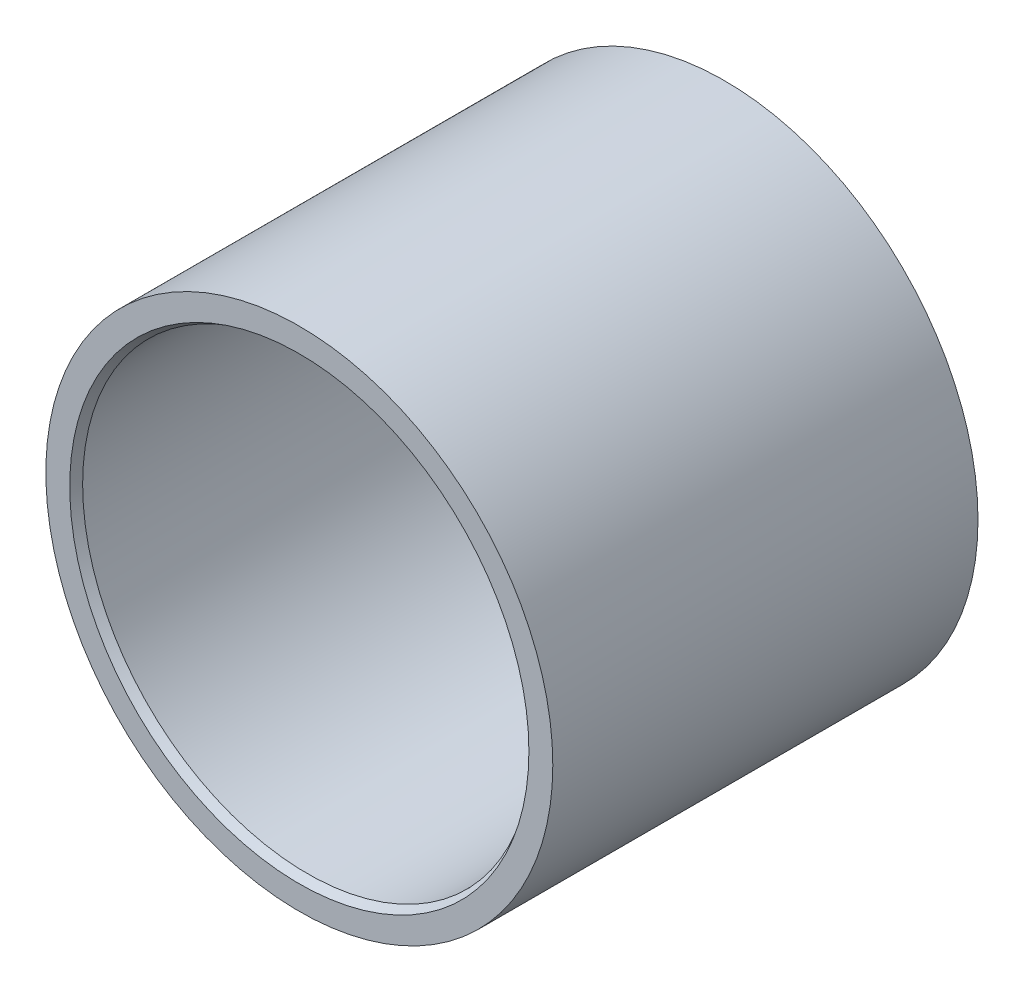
from build123d import *


with BuildPart() as part:
    # Esquisse1 → R_volution1 (revolve)
    with BuildSketch(Plane(origin=(0, 0, 0), x_dir=(0, 0, -1), z_dir=(1, 0, 0)), mode=Mode.PRIVATE) as r_volution1_sk:
        Polygon((1, 27.5), (52, 27.5), (52, 31), (0, 31), (0, 28.077350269), align=None)
    revolve(r_volution1_sk.sketch.rotate(Axis((0, 0, 0), (0, 0, -1)), 90), axis=Axis((0, 0, 0), (0, 0, -1)))


solid = part.part
